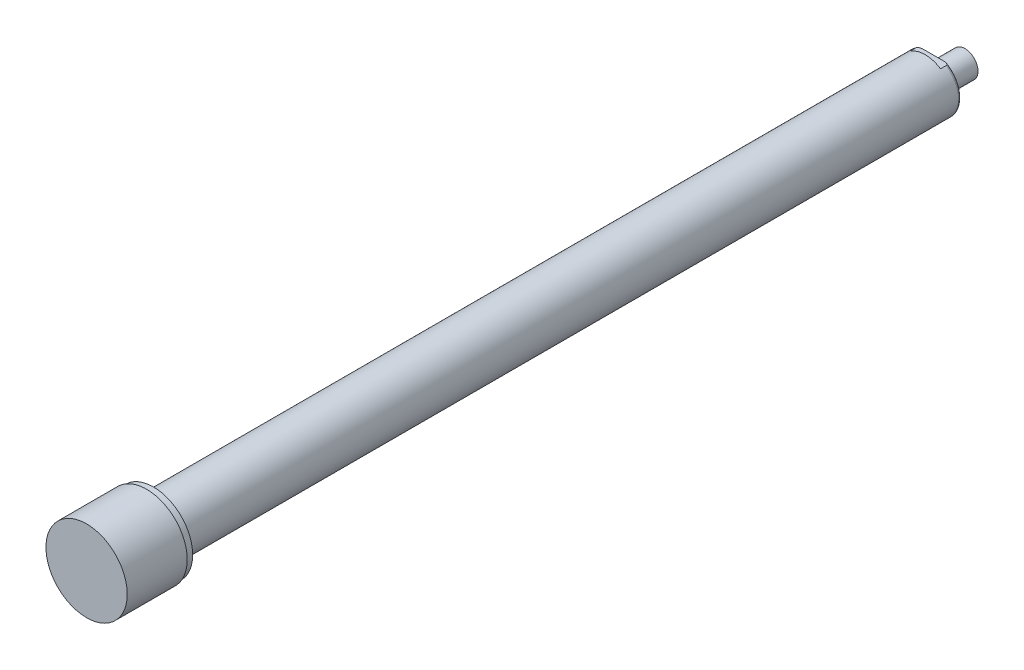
ISO-10303-21;
HEADER;
FILE_DESCRIPTION(('STEP AP214'),'2;1');
FILE_NAME('part.step','',(''),(''),'','','');
FILE_SCHEMA(('AUTOMOTIVE_DESIGN { 1 0 10303 214 1 1 1 1 }'));
ENDSEC;
DATA;
#1=APPLICATION_CONTEXT('core data for automotive mechanical design processes');
#2=APPLICATION_PROTOCOL_DEFINITION('international standard','automotive_design',2000,#1);
#3=PRODUCT_CONTEXT('',#1,'mechanical');
#4=PRODUCT('Part','Part','',(#3));
#5=PRODUCT_RELATED_PRODUCT_CATEGORY('part','',(#4));
#6=PRODUCT_DEFINITION_FORMATION('','',#4);
#7=PRODUCT_DEFINITION_CONTEXT('part definition',#1,'design');
#8=PRODUCT_DEFINITION('design','',#6,#7);
#9=PRODUCT_DEFINITION_SHAPE('','',#8);
#10=(LENGTH_UNIT() NAMED_UNIT(*) SI_UNIT(.MILLI.,.METRE.));
#11=(NAMED_UNIT(*) PLANE_ANGLE_UNIT() SI_UNIT($,.RADIAN.));
#12=(NAMED_UNIT(*) SI_UNIT($,.STERADIAN.) SOLID_ANGLE_UNIT());
#13=UNCERTAINTY_MEASURE_WITH_UNIT(LENGTH_MEASURE(1.E-05),#10,'distance_accuracy_value','');
#14=(GEOMETRIC_REPRESENTATION_CONTEXT(3) GLOBAL_UNCERTAINTY_ASSIGNED_CONTEXT((#13)) GLOBAL_UNIT_ASSIGNED_CONTEXT((#10,
#11,#12)) REPRESENTATION_CONTEXT('',''));
#15=CARTESIAN_POINT('',(0.,0.,0.));
#16=DIRECTION('',(0.,0.,1.));
#17=DIRECTION('',(1.,0.,0.));
#18=AXIS2_PLACEMENT_3D('',#15,#16,#17);
#19=CARTESIAN_POINT('',(0.,0.,2.55016));
#20=DIRECTION('',(0.,0.,1.));
#21=DIRECTION('',(1.,0.,0.));
#22=AXIS2_PLACEMENT_3D('',#19,#20,#21);
#23=PLANE('',#22);
#24=CARTESIAN_POINT('',(0.,0.,2.55016));
#25=DIRECTION('',(0.,0.,1.));
#26=DIRECTION('',(1.,0.,0.));
#27=AXIS2_PLACEMENT_3D('',#24,#25,#26);
#28=CIRCLE('',#27,24.765);
#29=CARTESIAN_POINT('',(24.765,0.,2.55016));
#30=VERTEX_POINT('',#29);
#31=EDGE_CURVE('E152',#30,#30,#28,.T.);
#32=ORIENTED_EDGE('',*,*,#31,.T.);
#33=EDGE_LOOP('',(#32));
#34=FACE_BOUND('',#33,.T.);
#35=ADVANCED_FACE('F16',(#34),#23,.T.);
#36=CARTESIAN_POINT('',(0.,0.,0.));
#37=DIRECTION('',(0.,0.,1.));
#38=DIRECTION('',(1.,0.,0.));
#39=AXIS2_PLACEMENT_3D('',#36,#37,#38);
#40=CYLINDRICAL_SURFACE('',#39,24.765);
#41=CARTESIAN_POINT('',(0.,0.,-34.));
#42=DIRECTION('',(0.,0.,1.));
#43=DIRECTION('',(1.,0.,0.));
#44=AXIS2_PLACEMENT_3D('',#41,#42,#43);
#45=CIRCLE('',#44,24.765);
#46=CARTESIAN_POINT('',(24.765,0.,-34.));
#47=VERTEX_POINT('',#46);
#48=EDGE_CURVE('E25',#47,#47,#45,.F.);
#49=ORIENTED_EDGE('',*,*,#48,.F.);
#50=EDGE_LOOP('',(#49));
#51=FACE_BOUND('',#50,.T.);
#52=ORIENTED_EDGE('',*,*,#31,.F.);
#53=EDGE_LOOP('',(#52));
#54=FACE_BOUND('',#53,.T.);
#55=ADVANCED_FACE('F182',(#51,#54),#40,.T.);
#56=CARTESIAN_POINT('',(0.,20.0152,-34.));
#57=DIRECTION('',(0.,0.,1.));
#58=DIRECTION('',(1.,0.,0.));
#59=AXIS2_PLACEMENT_3D('',#56,#57,#58);
#60=PLANE('',#59);
#61=CARTESIAN_POINT('',(0.,0.,-34.));
#62=DIRECTION('',(0.,0.,1.));
#63=DIRECTION('',(1.,0.,0.));
#64=AXIS2_PLACEMENT_3D('',#61,#62,#63);
#65=CIRCLE('',#64,23.876);
#66=CARTESIAN_POINT('',(23.876,0.,-34.));
#67=VERTEX_POINT('',#66);
#68=EDGE_CURVE('E10',#67,#67,#65,.F.);
#69=ORIENTED_EDGE('',*,*,#68,.F.);
#70=EDGE_LOOP('',(#69));
#71=FACE_BOUND('',#70,.T.);
#72=ORIENTED_EDGE('',*,*,#48,.T.);
#73=EDGE_LOOP('',(#72));
#74=FACE_BOUND('',#73,.T.);
#75=ADVANCED_FACE('F173',(#71,#74),#60,.F.);
#76=CARTESIAN_POINT('',(0.,8.,-532.5004));
#77=DIRECTION('',(0.,0.,-1.));
#78=DIRECTION('',(-1.,0.,0.));
#79=AXIS2_PLACEMENT_3D('',#76,#77,#78);
#80=PLANE('',#79);
#81=CARTESIAN_POINT('',(0.,0.,-532.5004));
#82=DIRECTION('',(0.,0.,-1.));
#83=DIRECTION('',(-1.,0.,0.));
#84=AXIS2_PLACEMENT_3D('',#81,#82,#83);
#85=CIRCLE('',#84,8.);
#86=CARTESIAN_POINT('',(-8.,0.,-532.5004));
#87=VERTEX_POINT('',#86);
#88=EDGE_CURVE('E130',#87,#87,#85,.T.);
#89=ORIENTED_EDGE('',*,*,#88,.T.);
#90=EDGE_LOOP('',(#89));
#91=FACE_BOUND('',#90,.T.);
#92=ADVANCED_FACE('F118',(#91),#80,.T.);
#93=CARTESIAN_POINT('',(0.,0.,-532.5004));
#94=DIRECTION('',(0.,0.,-1.));
#95=DIRECTION('',(-1.,0.,0.));
#96=AXIS2_PLACEMENT_3D('',#93,#94,#95);
#97=CYLINDRICAL_SURFACE('',#96,8.);
#98=CARTESIAN_POINT('',(0.,0.,-515.9904));
#99=DIRECTION('',(0.,0.,-1.));
#100=DIRECTION('',(-1.,0.,0.));
#101=AXIS2_PLACEMENT_3D('',#98,#99,#100);
#102=CIRCLE('',#101,8.);
#103=CARTESIAN_POINT('',(-8.,0.,-515.9904));
#104=VERTEX_POINT('',#103);
#105=EDGE_CURVE('E133',#104,#104,#102,.T.);
#106=ORIENTED_EDGE('',*,*,#105,.T.);
#107=EDGE_LOOP('',(#106));
#108=FACE_BOUND('',#107,.T.);
#109=ORIENTED_EDGE('',*,*,#88,.F.);
#110=EDGE_LOOP('',(#109));
#111=FACE_BOUND('',#110,.T.);
#112=ADVANCED_FACE('F172',(#108,#111),#97,.T.);
#113=CARTESIAN_POINT('',(0.,6.858,-515.9904));
#114=DIRECTION('',(0.,0.,1.));
#115=DIRECTION('',(1.,0.,0.));
#116=AXIS2_PLACEMENT_3D('',#113,#114,#115);
#117=PLANE('',#116);
#118=CARTESIAN_POINT('',(0.,0.,-515.9904));
#119=DIRECTION('',(0.,0.,-1.));
#120=DIRECTION('',(-1.,0.,0.));
#121=AXIS2_PLACEMENT_3D('',#118,#119,#120);
#122=CIRCLE('',#121,6.858);
#123=CARTESIAN_POINT('',(-6.858,0.,-515.9904));
#124=VERTEX_POINT('',#123);
#125=EDGE_CURVE('E136',#124,#124,#122,.T.);
#126=ORIENTED_EDGE('',*,*,#125,.T.);
#127=EDGE_LOOP('',(#126));
#128=FACE_BOUND('',#127,.T.);
#129=ORIENTED_EDGE('',*,*,#105,.F.);
#130=EDGE_LOOP('',(#129));
#131=FACE_BOUND('',#130,.T.);
#132=ADVANCED_FACE('F180',(#128,#131),#117,.T.);
#133=CARTESIAN_POINT('',(0.,0.,-532.5004));
#134=DIRECTION('',(0.,0.,-1.));
#135=DIRECTION('',(-1.,0.,0.));
#136=AXIS2_PLACEMENT_3D('',#133,#134,#135);
#137=CYLINDRICAL_SURFACE('',#136,6.858);
#138=CARTESIAN_POINT('',(0.,0.,-513.4504));
#139=DIRECTION('',(0.,0.,-1.));
#140=DIRECTION('',(-1.,0.,0.));
#141=AXIS2_PLACEMENT_3D('',#138,#139,#140);
#142=CIRCLE('',#141,6.858);
#143=CARTESIAN_POINT('',(-6.858,0.,-513.4504));
#144=VERTEX_POINT('',#143);
#145=EDGE_CURVE('E139',#144,#144,#142,.T.);
#146=ORIENTED_EDGE('',*,*,#145,.T.);
#147=EDGE_LOOP('',(#146));
#148=FACE_BOUND('',#147,.T.);
#149=ORIENTED_EDGE('',*,*,#125,.F.);
#150=EDGE_LOOP('',(#149));
#151=FACE_BOUND('',#150,.T.);
#152=ADVANCED_FACE('F311',(#148,#151),#137,.T.);
#153=CARTESIAN_POINT('',(0.,15.2125,-513.4504));
#154=DIRECTION('',(0.,0.,-1.));
#155=DIRECTION('',(-1.,0.,0.));
#156=AXIS2_PLACEMENT_3D('',#153,#154,#155);
#157=PLANE('',#156);
#158=DIRECTION('',(-1.,0.,0.));
#159=VECTOR('',#158,1.);
#160=CARTESIAN_POINT('',(0.,14.,-513.4504));
#161=LINE('',#160,#159);
#162=CARTESIAN_POINT('',(5.95148353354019,14.,-513.4504));
#163=VERTEX_POINT('',#162);
#164=CARTESIAN_POINT('',(-5.95148353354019,14.,-513.4504));
#165=VERTEX_POINT('',#164);
#166=EDGE_CURVE('E151',#163,#165,#161,.T.);
#167=ORIENTED_EDGE('',*,*,#166,.F.);
#168=CARTESIAN_POINT('',(0.,0.,-513.4504));
#169=DIRECTION('',(0.,0.,-1.));
#170=DIRECTION('',(-1.,0.,0.));
#171=AXIS2_PLACEMENT_3D('',#168,#169,#170);
#172=CIRCLE('',#171,15.2125);
#173=CARTESIAN_POINT('',(5.95148353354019,-14.,-513.4504));
#174=VERTEX_POINT('',#173);
#175=EDGE_CURVE('E142',#163,#174,#172,.T.);
#176=ORIENTED_EDGE('',*,*,#175,.T.);
#177=DIRECTION('',(1.,0.,0.));
#178=VECTOR('',#177,1.);
#179=CARTESIAN_POINT('',(0.,-14.,-513.4504));
#180=LINE('',#179,#178);
#181=CARTESIAN_POINT('',(-5.95148353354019,-14.,-513.4504));
#182=VERTEX_POINT('',#181);
#183=EDGE_CURVE('E149',#182,#174,#180,.T.);
#184=ORIENTED_EDGE('',*,*,#183,.F.);
#185=EDGE_CURVE('E143',#182,#165,#172,.T.);
#186=ORIENTED_EDGE('',*,*,#185,.T.);
#187=EDGE_LOOP('',(#167,#176,#184,#186));
#188=FACE_BOUND('',#187,.T.);
#189=ORIENTED_EDGE('',*,*,#145,.F.);
#190=EDGE_LOOP('',(#189));
#191=FACE_BOUND('',#190,.T.);
#192=ADVANCED_FACE('F302',(#188,#191),#157,.T.);
#193=CARTESIAN_POINT('',(0.,0.,-508.3704));
#194=DIRECTION('',(0.,0.,-1.));
#195=DIRECTION('',(-1.,0.,0.));
#196=AXIS2_PLACEMENT_3D('',#193,#194,#195);
#197=PLANE('',#196);
#198=CARTESIAN_POINT('',(0.,0.,-508.3704));
#199=DIRECTION('',(0.,0.,-1.));
#200=DIRECTION('',(-1.,0.,0.));
#201=AXIS2_PLACEMENT_3D('',#198,#199,#200);
#202=CIRCLE('',#201,16.8);
#203=CARTESIAN_POINT('',(-9.28654941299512,14.,-508.3704));
#204=VERTEX_POINT('',#203);
#205=CARTESIAN_POINT('',(9.28654941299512,14.,-508.3704));
#206=VERTEX_POINT('',#205);
#207=EDGE_CURVE('E72',#204,#206,#202,.T.);
#208=ORIENTED_EDGE('',*,*,#207,.T.);
#209=DIRECTION('',(-1.,0.,0.));
#210=VECTOR('',#209,1.);
#211=CARTESIAN_POINT('',(9.28654941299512,14.,-508.3704));
#212=LINE('',#211,#210);
#213=EDGE_CURVE('E75',#206,#204,#212,.T.);
#214=ORIENTED_EDGE('',*,*,#213,.T.);
#215=EDGE_LOOP('',(#208,#214));
#216=FACE_BOUND('',#215,.T.);
#217=ADVANCED_FACE('F74',(#216),#197,.T.);
#218=CARTESIAN_POINT('',(0.,0.,-511.8629));
#219=DIRECTION('',(0.,0.,-1.));
#220=DIRECTION('',(-1.,0.,0.));
#221=AXIS2_PLACEMENT_3D('',#218,#219,#220);
#222=TOROIDAL_SURFACE('',#221,15.2125,1.5875);
#223=CARTESIAN_POINT('',(0.,14.,-512.887595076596));
#224=CARTESIAN_POINT('',(-0.132768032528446,14.,-512.887593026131));
#225=CARTESIAN_POINT('',(-0.265533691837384,14.,-512.889844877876));
#226=CARTESIAN_POINT('',(-0.5309243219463,14.,-512.898671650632));
#227=CARTESIAN_POINT('',(-0.663549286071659,14.,-512.905246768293));
#228=CARTESIAN_POINT('',(-1.06113740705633,14.,-512.93082076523));
#229=CARTESIAN_POINT('',(-1.32572041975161,14.,-512.955667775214));
#230=CARTESIAN_POINT('',(-1.85467558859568,14.,-513.015304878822));
#231=CARTESIAN_POINT('',(-2.11904315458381,14.,-513.05013225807));
#232=CARTESIAN_POINT('',(-2.64722640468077,14.,-513.123362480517));
#233=CARTESIAN_POINT('',(-2.91104215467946,14.,-513.161764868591));
#234=CARTESIAN_POINT('',(-3.34668840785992,14.,-513.223564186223));
#235=CARTESIAN_POINT('',(-3.51843693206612,14.,-513.24751393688));
#236=CARTESIAN_POINT('',(-3.86222256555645,14.,-513.293226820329));
#237=CARTESIAN_POINT('',(-4.03425968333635,14.,-513.314989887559));
#238=CARTESIAN_POINT('',(-4.5509687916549,14.,-513.375020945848));
#239=CARTESIAN_POINT('',(-4.89633775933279,14.,-513.408046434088));
#240=CARTESIAN_POINT('',(-5.43248455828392,14.,-513.439635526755));
#241=CARTESIAN_POINT('',(-5.62271612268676,14.,-513.447024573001));
#242=CARTESIAN_POINT('',(-6.00342493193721,14.,-513.451964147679));
#243=CARTESIAN_POINT('',(-6.19390224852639,14.,-513.449510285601));
#244=CARTESIAN_POINT('',(-6.57443040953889,14.,-513.43206589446));
#245=CARTESIAN_POINT('',(-6.76448114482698,14.,-513.417072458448));
#246=CARTESIAN_POINT('',(-7.04800150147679,14.,-513.382528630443));
#247=CARTESIAN_POINT('',(-7.14221305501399,14.,-513.369012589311));
#248=CARTESIAN_POINT('',(-7.32985530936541,14.,-513.337394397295));
#249=CARTESIAN_POINT('',(-7.42328618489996,14.,-513.319293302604));
#250=CARTESIAN_POINT('',(-7.60981224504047,14.,-513.277657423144));
#251=CARTESIAN_POINT('',(-7.70289714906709,14.,-513.254075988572));
#252=CARTESIAN_POINT('',(-7.88726094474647,14.,-513.20074825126));
#253=CARTESIAN_POINT('',(-7.97854070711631,14.,-513.17100500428));
#254=CARTESIAN_POINT('',(-8.15800808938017,14.,-513.104496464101));
#255=CARTESIAN_POINT('',(-8.24620915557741,14.,-513.067767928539));
#256=CARTESIAN_POINT('',(-8.41861308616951,14.,-512.985991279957));
#257=CARTESIAN_POINT('',(-8.5028211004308,14.,-512.940954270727));
#258=CARTESIAN_POINT('',(-8.64739637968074,14.,-512.852038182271));
#259=CARTESIAN_POINT('',(-8.70893575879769,14.,-512.810080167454));
#260=CARTESIAN_POINT('',(-8.82695536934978,14.,-512.719330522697));
#261=CARTESIAN_POINT('',(-8.88342980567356,14.,-512.670531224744));
#262=CARTESIAN_POINT('',(-8.98963579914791,14.,-512.564856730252));
#263=CARTESIAN_POINT('',(-9.0392861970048,14.,-512.507898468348));
#264=CARTESIAN_POINT('',(-9.1277798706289,14.,-512.3861116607));
#265=CARTESIAN_POINT('',(-9.16665238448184,14.,-512.321305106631));
#266=CARTESIAN_POINT('',(-9.22003745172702,14.,-512.205711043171));
#267=CARTESIAN_POINT('',(-9.23836397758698,14.,-512.156688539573));
#268=CARTESIAN_POINT('',(-9.26663253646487,14.,-512.056274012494));
#269=CARTESIAN_POINT('',(-9.27658176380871,14.,-512.00488406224));
#270=CARTESIAN_POINT('',(-9.28727482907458,14.,-511.90094216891));
#271=CARTESIAN_POINT('',(-9.28798383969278,14.,-511.84838657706));
#272=CARTESIAN_POINT('',(-9.28004044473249,14.,-511.74398713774));
#273=CARTESIAN_POINT('',(-9.27138562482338,14.,-511.692143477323));
#274=CARTESIAN_POINT('',(-9.24609238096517,14.,-511.593096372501));
#275=CARTESIAN_POINT('',(-9.22985055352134,14.,-511.545789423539));
#276=CARTESIAN_POINT('',(-9.19066177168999,14.,-511.454071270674));
#277=CARTESIAN_POINT('',(-9.16771223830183,14.,-511.409661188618));
#278=CARTESIAN_POINT('',(-9.1028532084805,14.,-511.301841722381));
#279=CARTESIAN_POINT('',(-9.05730159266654,14.,-511.240624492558));
#280=CARTESIAN_POINT('',(-8.95711629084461,14.,-511.12613877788));
#281=CARTESIAN_POINT('',(-8.90245884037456,14.,-511.072891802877));
#282=CARTESIAN_POINT('',(-8.75205778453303,14.,-510.943960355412));
#283=CARTESIAN_POINT('',(-8.6513883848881,14.,-510.874065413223));
#284=CARTESIAN_POINT('',(-8.44094705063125,14.,-510.749906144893));
#285=CARTESIAN_POINT('',(-8.33115456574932,14.,-510.695678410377));
#286=CARTESIAN_POINT('',(-8.11312892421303,14.,-510.602886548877));
#287=CARTESIAN_POINT('',(-8.0052101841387,14.,-510.563567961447));
#288=CARTESIAN_POINT('',(-7.78638225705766,14.,-510.494218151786));
#289=CARTESIAN_POINT('',(-7.67547044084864,14.,-510.46419540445));
#290=CARTESIAN_POINT('',(-7.45172845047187,14.,-510.41194530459));
#291=CARTESIAN_POINT('',(-7.33889625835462,14.,-510.389726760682));
#292=CARTESIAN_POINT('',(-7.11210332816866,14.,-510.351935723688));
#293=CARTESIAN_POINT('',(-6.9981421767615,14.,-510.336365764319));
#294=CARTESIAN_POINT('',(-6.76357841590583,14.,-510.310250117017));
#295=CARTESIAN_POINT('',(-6.64294221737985,14.,-510.300012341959));
#296=CARTESIAN_POINT('',(-6.40132401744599,14.,-510.284929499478));
#297=CARTESIAN_POINT('',(-6.28034194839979,14.,-510.28008557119));
#298=CARTESIAN_POINT('',(-5.91706739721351,14.,-510.272460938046));
#299=CARTESIAN_POINT('',(-5.67462782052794,14.,-510.276605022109));
#300=CARTESIAN_POINT('',(-5.18958172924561,14.,-510.298383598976));
#301=CARTESIAN_POINT('',(-4.94697788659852,14.,-510.316067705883));
#302=CARTESIAN_POINT('',(-4.4628147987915,14.,-510.360899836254));
#303=CARTESIAN_POINT('',(-4.22125506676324,14.,-510.388042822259));
#304=CARTESIAN_POINT('',(-3.66652722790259,14.,-510.457108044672));
#305=CARTESIAN_POINT('',(-3.35361868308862,14.,-510.50102115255));
#306=CARTESIAN_POINT('',(-2.72786060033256,14.,-510.59038682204));
#307=CARTESIAN_POINT('',(-2.41501121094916,14.,-510.635840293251));
#308=CARTESIAN_POINT('',(-1.7909190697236,14.,-510.718284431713));
#309=CARTESIAN_POINT('',(-1.4796869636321,14.,-510.755347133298));
#310=CARTESIAN_POINT('',(-1.01173384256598,14.,-510.797283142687));
#311=CARTESIAN_POINT('',(-0.85564734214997,14.,-510.808982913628));
#312=CARTESIAN_POINT('',(-0.543154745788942,14.,-510.826808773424));
#313=CARTESIAN_POINT('',(-0.386748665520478,14.,-510.832935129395));
#314=CARTESIAN_POINT('',(-0.0729452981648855,14.,-510.839018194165));
#315=CARTESIAN_POINT('',(0.0844526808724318,14.,-510.838940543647));
#316=CARTESIAN_POINT('',(0.399120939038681,14.,-510.832538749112));
#317=CARTESIAN_POINT('',(0.556391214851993,14.,-510.826214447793));
#318=CARTESIAN_POINT('',(0.870747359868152,14.,-510.807945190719));
#319=CARTESIAN_POINT('',(1.02783290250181,14.,-510.795994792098));
#320=CARTESIAN_POINT('',(1.34159739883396,14.,-510.767550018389));
#321=CARTESIAN_POINT('',(1.49827630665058,14.,-510.751055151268));
#322=CARTESIAN_POINT('',(1.81316576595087,14.,-510.714583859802));
#323=CARTESIAN_POINT('',(1.97137154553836,14.,-510.694567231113));
#324=CARTESIAN_POINT('',(2.28750928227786,14.,-510.652537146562));
#325=CARTESIAN_POINT('',(2.44544124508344,14.,-510.630523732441));
#326=CARTESIAN_POINT('',(2.91891159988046,14.,-510.563449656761));
#327=CARTESIAN_POINT('',(3.23429351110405,14.,-510.517332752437));
#328=CARTESIAN_POINT('',(3.86696922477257,14.,-510.431141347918));
#329=CARTESIAN_POINT('',(4.18426592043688,14.,-510.39108632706));
#330=CARTESIAN_POINT('',(4.6616022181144,14.,-510.341907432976));
#331=CARTESIAN_POINT('',(4.82106369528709,14.,-510.327325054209));
#332=CARTESIAN_POINT('',(5.14034359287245,14.,-510.302922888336));
#333=CARTESIAN_POINT('',(5.30016197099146,14.,-510.293102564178));
#334=CARTESIAN_POINT('',(5.61795638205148,14.,-510.279521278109));
#335=CARTESIAN_POINT('',(5.77592887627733,14.,-510.275682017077));
#336=CARTESIAN_POINT('',(6.09195057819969,14.,-510.27514758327));
#337=CARTESIAN_POINT('',(6.24999979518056,14.,-510.278454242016));
#338=CARTESIAN_POINT('',(6.56527224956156,14.,-510.293786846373));
#339=CARTESIAN_POINT('',(6.72249656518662,14.,-510.305789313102));
#340=CARTESIAN_POINT('',(7.03573124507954,14.,-510.340441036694));
#341=CARTESIAN_POINT('',(7.19174244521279,14.,-510.363082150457));
#342=CARTESIAN_POINT('',(7.41615197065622,14.,-510.405489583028));
#343=CARTESIAN_POINT('',(7.48555710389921,14.,-510.419991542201));
#344=CARTESIAN_POINT('',(7.62369369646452,14.,-510.451975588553));
#345=CARTESIAN_POINT('',(7.69242507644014,14.,-510.469458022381));
#346=CARTESIAN_POINT('',(7.82924857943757,14.,-510.507814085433));
#347=CARTESIAN_POINT('',(7.8973368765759,14.,-510.528701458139));
#348=CARTESIAN_POINT('',(8.03225786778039,14.,-510.574211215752));
#349=CARTESIAN_POINT('',(8.099090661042,14.,-510.598833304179));
#350=CARTESIAN_POINT('',(8.23194606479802,14.,-510.652631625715));
#351=CARTESIAN_POINT('',(8.29794618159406,14.,-510.681863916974));
#352=CARTESIAN_POINT('',(8.42761843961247,14.,-510.745218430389));
#353=CARTESIAN_POINT('',(8.49128951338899,14.,-510.779342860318));
#354=CARTESIAN_POINT('',(8.61506191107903,14.,-510.85292848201));
#355=CARTESIAN_POINT('',(8.67517993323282,14.,-510.892361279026));
#356=CARTESIAN_POINT('',(8.79087032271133,14.,-510.977343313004));
#357=CARTESIAN_POINT('',(8.84644896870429,14.,-511.022883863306));
#358=CARTESIAN_POINT('',(8.94548291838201,14.,-511.115317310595));
#359=CARTESIAN_POINT('',(8.98959902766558,14.,-511.161494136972));
#360=CARTESIAN_POINT('',(9.07112763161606,14.,-511.259534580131));
#361=CARTESIAN_POINT('',(9.10853908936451,14.,-511.311399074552));
#362=CARTESIAN_POINT('',(9.17478487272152,14.,-511.421313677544));
#363=CARTESIAN_POINT('',(9.20351043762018,14.,-511.479430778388));
#364=CARTESIAN_POINT('',(9.24908813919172,14.,-511.600152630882));
#365=CARTESIAN_POINT('',(9.26596285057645,14.,-511.662748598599));
#366=CARTESIAN_POINT('',(9.28464960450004,14.,-511.782335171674));
#367=CARTESIAN_POINT('',(9.28804963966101,14.,-511.83907661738));
#368=CARTESIAN_POINT('',(9.28382966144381,14.,-511.952145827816));
#369=CARTESIAN_POINT('',(9.27621073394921,14.,-512.008473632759));
#370=CARTESIAN_POINT('',(9.25229003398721,14.,-512.112102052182));
#371=CARTESIAN_POINT('',(9.23713577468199,14.,-512.159676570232));
#372=CARTESIAN_POINT('',(9.19997892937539,14.,-512.252038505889));
#373=CARTESIAN_POINT('',(9.17797466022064,14.,-512.296825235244));
#374=CARTESIAN_POINT('',(9.11609014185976,14.,-512.404302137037));
#375=CARTESIAN_POINT('',(9.07273694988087,14.,-512.464990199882));
#376=CARTESIAN_POINT('',(8.97697606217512,14.,-512.578741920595));
#377=CARTESIAN_POINT('',(8.92454537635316,14.,-512.631785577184));
#378=CARTESIAN_POINT('',(8.78073012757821,14.,-512.759735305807));
#379=CARTESIAN_POINT('',(8.68454281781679,14.,-512.829202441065));
#380=CARTESIAN_POINT('',(8.48303059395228,14.,-512.953115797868));
#381=CARTESIAN_POINT('',(8.37768429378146,14.,-513.007525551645));
#382=CARTESIAN_POINT('',(8.16908427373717,14.,-513.100673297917));
#383=CARTESIAN_POINT('',(8.06619117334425,14.,-513.140235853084));
#384=CARTESIAN_POINT('',(7.85737031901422,14.,-513.210483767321));
#385=CARTESIAN_POINT('',(7.75143986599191,14.,-513.241160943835));
#386=CARTESIAN_POINT('',(7.53762663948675,14.,-513.295024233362));
#387=CARTESIAN_POINT('',(7.42974224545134,14.,-513.318203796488));
#388=CARTESIAN_POINT('',(7.21287186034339,14.,-513.358141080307));
#389=CARTESIAN_POINT('',(7.10388648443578,14.,-513.374902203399));
#390=CARTESIAN_POINT('',(6.89130219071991,14.,-513.402143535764));
#391=CARTESIAN_POINT('',(6.78774054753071,14.,-513.412921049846));
#392=CARTESIAN_POINT('',(6.58025497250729,14.,-513.430196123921));
#393=CARTESIAN_POINT('',(6.47633098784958,14.,-513.436693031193));
#394=CARTESIAN_POINT('',(6.16416768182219,14.,-513.450589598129));
#395=CARTESIAN_POINT('',(5.95567421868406,14.,-513.452379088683));
#396=CARTESIAN_POINT('',(5.53835436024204,14.,-513.44450473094));
#397=CARTESIAN_POINT('',(5.32952888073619,14.,-513.434806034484));
#398=CARTESIAN_POINT('',(4.91243398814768,14.,-513.406724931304));
#399=CARTESIAN_POINT('',(4.70416474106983,14.,-513.388340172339));
#400=CARTESIAN_POINT('',(4.28654719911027,14.,-513.345186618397));
#401=CARTESIAN_POINT('',(4.07720452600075,14.,-513.320365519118));
#402=CARTESIAN_POINT('',(3.6590508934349,14.,-513.266814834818));
#403=CARTESIAN_POINT('',(3.45023989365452,14.,-513.238085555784));
#404=CARTESIAN_POINT('',(3.03316786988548,14.,-513.179210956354));
#405=CARTESIAN_POINT('',(2.82490650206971,14.,-513.149067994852));
#406=CARTESIAN_POINT('',(2.40822602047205,14.,-513.089971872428));
#407=CARTESIAN_POINT('',(2.19980692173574,14.,-513.061018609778));
#408=CARTESIAN_POINT('',(1.82558056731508,14.,-513.012810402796));
#409=CARTESIAN_POINT('',(1.65987471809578,14.,-512.992788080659));
#410=CARTESIAN_POINT('',(1.32795613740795,14.,-512.956904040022));
#411=CARTESIAN_POINT('',(1.1617432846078,14.,-512.941043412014));
#412=CARTESIAN_POINT('',(0.829734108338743,14.,-512.915025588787));
#413=CARTESIAN_POINT('',(0.663940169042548,14.,-512.904838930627));
#414=CARTESIAN_POINT('',(0.332096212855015,14.,-512.891125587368));
#415=CARTESIAN_POINT('',(0.166046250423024,14.,-512.887597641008));
#416=CARTESIAN_POINT('',(0.,14.,-512.887595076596));
#417=B_SPLINE_CURVE_WITH_KNOTS('',3,(#223,#224,#225,#226,#227,#228,#229,#230,#231,#232,#233,
#234,#235,#236,#237,#238,#239,#240,#241,#242,#243,#244,#245,#246,#247,#248,#249,#250,#251,#252,
#253,#254,#255,#256,#257,#258,#259,#260,#261,#262,#263,#264,#265,#266,#267,#268,#269,#270,#271,
#272,#273,#274,#275,#276,#277,#278,#279,#280,#281,#282,#283,#284,#285,#286,#287,#288,#289,#290,
#291,#292,#293,#294,#295,#296,#297,#298,#299,#300,#301,#302,#303,#304,#305,#306,#307,#308,#309,
#310,#311,#312,#313,#314,#315,#316,#317,#318,#319,#320,#321,#322,#323,#324,#325,#326,#327,#328,
#329,#330,#331,#332,#333,#334,#335,#336,#337,#338,#339,#340,#341,#342,#343,#344,#345,#346,#347,
#348,#349,#350,#351,#352,#353,#354,#355,#356,#357,#358,#359,#360,#361,#362,#363,#364,#365,#366,
#367,#368,#369,#370,#371,#372,#373,#374,#375,#376,#377,#378,#379,#380,#381,#382,#383,#384,#385,
#386,#387,#388,#389,#390,#391,#392,#393,#394,#395,#396,#397,#398,#399,#400,#401,#402,#403,#404,
#405,#406,#407,#408,#409,#410,#411,#412,#413,#414,#415,#416),.UNSPECIFIED.,.T.,.F.,(4,2,2,2,2,2,
2,2,2,2,2,2,2,2,2,2,2,2,2,2,2,2,2,2,2,2,2,2,2,2,2,2,2,2,2,2,2,2,2,2,2,2,2,2,2,2,2,2,2,2,2,2,2,2,
2,2,2,2,2,2,2,2,2,2,2,2,2,2,2,2,2,2,2,2,2,2,2,2,2,2,2,2,2,2,2,2,2,2,2,2,2,2,2,2,2,2,4),(0.,
0.398281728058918,0.796581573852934,1.59346088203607,2.39335695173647,3.19315132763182,
3.71336857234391,4.23360141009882,5.27376582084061,5.84469365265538,6.41587617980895,
6.98719115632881,7.27262913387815,7.55800141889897,7.84589809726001,8.13365234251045,
8.41993230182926,8.70583240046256,8.92889552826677,9.15221070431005,9.37798665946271,
9.60314400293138,9.75952095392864,9.91576347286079,10.0725947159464,10.2294664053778,
10.3789250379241,10.5284412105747,10.7560526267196,10.9842676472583,11.3498680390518,
11.7163155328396,12.0603788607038,12.404754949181,12.7495184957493,13.0944133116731,
13.4574784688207,13.8206202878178,14.547448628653,15.2769530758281,16.0060696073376,
16.9539379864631,17.902376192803,18.8423341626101,19.3118216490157,19.7812866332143,
20.2533518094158,20.7254288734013,21.1979635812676,21.670549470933,22.1489292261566,
22.6272989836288,23.5835269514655,24.54276525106,25.0230897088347,25.5033599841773,
25.977288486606,26.4513384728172,26.9241132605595,27.3965267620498,27.6091866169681,
27.8218712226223,28.0354365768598,28.2489849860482,28.4653650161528,28.681843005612,
28.897205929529,29.1122657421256,29.303362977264,29.4944897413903,29.6879190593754,
29.8809789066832,30.0504588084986,30.2199220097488,30.3691164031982,30.518347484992,
30.7408251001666,30.963874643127,31.3178265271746,31.6726282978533,32.0028505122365,
32.3333758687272,32.664189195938,32.9948269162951,33.3070886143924,33.6193979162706,
34.2444298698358,34.8713626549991,35.4984653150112,36.1308331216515,36.7631514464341,
37.3944498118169,38.0256940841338,38.5263936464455,39.0272242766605,39.5254294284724,
40.0235402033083),.UNSPECIFIED.);
#418=CARTESIAN_POINT('',(9.28654941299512,14.,-511.8629));
#419=VERTEX_POINT('',#418);
#420=EDGE_CURVE('E33',#419,#163,#417,.T.);
#421=ORIENTED_EDGE('',*,*,#420,.F.);
#422=CARTESIAN_POINT('',(0.,0.,-511.8629));
#423=DIRECTION('',(0.,0.,-1.));
#424=DIRECTION('',(-1.,0.,0.));
#425=AXIS2_PLACEMENT_3D('',#422,#423,#424);
#426=CIRCLE('',#425,16.8);
#427=CARTESIAN_POINT('',(9.28654941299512,-14.,-511.8629));
#428=VERTEX_POINT('',#427);
#429=EDGE_CURVE('E86',#419,#428,#426,.T.);
#430=ORIENTED_EDGE('',*,*,#429,.T.);
#431=CARTESIAN_POINT('',(0.,-14.,-512.887595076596));
#432=CARTESIAN_POINT('',(0.132768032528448,-14.,-512.887593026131));
#433=CARTESIAN_POINT('',(0.265533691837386,-14.,-512.889844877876));
#434=CARTESIAN_POINT('',(0.530924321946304,-14.,-512.898671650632));
#435=CARTESIAN_POINT('',(0.663549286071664,-14.,-512.905246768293));
#436=CARTESIAN_POINT('',(1.06113740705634,-14.,-512.93082076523));
#437=CARTESIAN_POINT('',(1.32572041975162,-14.,-512.955667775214));
#438=CARTESIAN_POINT('',(1.85467558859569,-14.,-513.015304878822));
#439=CARTESIAN_POINT('',(2.11904315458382,-14.,-513.05013225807));
#440=CARTESIAN_POINT('',(2.64722640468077,-14.,-513.123362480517));
#441=CARTESIAN_POINT('',(2.91104215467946,-14.,-513.161764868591));
#442=CARTESIAN_POINT('',(3.34668840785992,-14.,-513.223564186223));
#443=CARTESIAN_POINT('',(3.51843693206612,-14.,-513.24751393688));
#444=CARTESIAN_POINT('',(3.86222256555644,-14.,-513.293226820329));
#445=CARTESIAN_POINT('',(4.03425968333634,-14.,-513.314989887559));
#446=CARTESIAN_POINT('',(4.55096879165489,-14.,-513.375020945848));
#447=CARTESIAN_POINT('',(4.89633775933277,-14.,-513.408046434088));
#448=CARTESIAN_POINT('',(5.43248455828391,-14.,-513.439635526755));
#449=CARTESIAN_POINT('',(5.62271612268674,-14.,-513.447024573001));
#450=CARTESIAN_POINT('',(6.00342493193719,-14.,-513.451964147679));
#451=CARTESIAN_POINT('',(6.19390224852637,-14.,-513.449510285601));
#452=CARTESIAN_POINT('',(6.57443040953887,-14.,-513.43206589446));
#453=CARTESIAN_POINT('',(6.76448114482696,-14.,-513.417072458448));
#454=CARTESIAN_POINT('',(7.04800150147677,-14.,-513.382528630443));
#455=CARTESIAN_POINT('',(7.14221305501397,-14.,-513.369012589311));
#456=CARTESIAN_POINT('',(7.32985530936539,-14.,-513.337394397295));
#457=CARTESIAN_POINT('',(7.42328618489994,-14.,-513.319293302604));
#458=CARTESIAN_POINT('',(7.60981224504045,-14.,-513.277657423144));
#459=CARTESIAN_POINT('',(7.70289714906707,-14.,-513.254075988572));
#460=CARTESIAN_POINT('',(7.88726094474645,-14.,-513.20074825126));
#461=CARTESIAN_POINT('',(7.97854070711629,-14.,-513.17100500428));
#462=CARTESIAN_POINT('',(8.15800808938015,-14.,-513.104496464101));
#463=CARTESIAN_POINT('',(8.24620915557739,-14.,-513.067767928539));
#464=CARTESIAN_POINT('',(8.41861308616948,-14.,-512.985991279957));
#465=CARTESIAN_POINT('',(8.50282110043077,-14.,-512.940954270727));
#466=CARTESIAN_POINT('',(8.64739637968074,-14.,-512.852038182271));
#467=CARTESIAN_POINT('',(8.70893575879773,-14.,-512.810080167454));
#468=CARTESIAN_POINT('',(8.82695536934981,-14.,-512.719330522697));
#469=CARTESIAN_POINT('',(8.88342980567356,-14.,-512.670531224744));
#470=CARTESIAN_POINT('',(8.98963579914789,-14.,-512.564856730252));
#471=CARTESIAN_POINT('',(9.03928619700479,-14.,-512.507898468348));
#472=CARTESIAN_POINT('',(9.12777987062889,-14.,-512.3861116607));
#473=CARTESIAN_POINT('',(9.16665238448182,-14.,-512.321305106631));
#474=CARTESIAN_POINT('',(9.22003745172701,-14.,-512.205711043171));
#475=CARTESIAN_POINT('',(9.23836397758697,-14.,-512.156688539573));
#476=CARTESIAN_POINT('',(9.26663253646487,-14.,-512.056274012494));
#477=CARTESIAN_POINT('',(9.27658176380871,-14.,-512.00488406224));
#478=CARTESIAN_POINT('',(9.28727482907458,-14.,-511.90094216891));
#479=CARTESIAN_POINT('',(9.28798383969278,-14.,-511.84838657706));
#480=CARTESIAN_POINT('',(9.28004044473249,-14.,-511.74398713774));
#481=CARTESIAN_POINT('',(9.27138562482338,-14.,-511.692143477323));
#482=CARTESIAN_POINT('',(9.24609238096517,-14.,-511.593096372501));
#483=CARTESIAN_POINT('',(9.22985055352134,-14.,-511.545789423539));
#484=CARTESIAN_POINT('',(9.19066177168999,-14.,-511.454071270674));
#485=CARTESIAN_POINT('',(9.16771223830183,-14.,-511.409661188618));
#486=CARTESIAN_POINT('',(9.1028532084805,-14.,-511.301841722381));
#487=CARTESIAN_POINT('',(9.05730159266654,-14.,-511.240624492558));
#488=CARTESIAN_POINT('',(8.95711629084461,-14.,-511.12613877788));
#489=CARTESIAN_POINT('',(8.90245884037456,-14.,-511.072891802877));
#490=CARTESIAN_POINT('',(8.75205778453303,-14.,-510.943960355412));
#491=CARTESIAN_POINT('',(8.65138838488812,-14.,-510.874065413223));
#492=CARTESIAN_POINT('',(8.44094705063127,-14.,-510.749906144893));
#493=CARTESIAN_POINT('',(8.33115456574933,-14.,-510.695678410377));
#494=CARTESIAN_POINT('',(8.11312892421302,-14.,-510.602886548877));
#495=CARTESIAN_POINT('',(8.0052101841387,-14.,-510.563567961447));
#496=CARTESIAN_POINT('',(7.78638225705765,-14.,-510.494218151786));
#497=CARTESIAN_POINT('',(7.67547044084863,-14.,-510.46419540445));
#498=CARTESIAN_POINT('',(7.45172845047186,-14.,-510.41194530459));
#499=CARTESIAN_POINT('',(7.33889625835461,-14.,-510.389726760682));
#500=CARTESIAN_POINT('',(7.11210332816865,-14.,-510.351935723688));
#501=CARTESIAN_POINT('',(6.99814217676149,-14.,-510.336365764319));
#502=CARTESIAN_POINT('',(6.76357841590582,-14.,-510.310250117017));
#503=CARTESIAN_POINT('',(6.64294221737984,-14.,-510.300012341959));
#504=CARTESIAN_POINT('',(6.40132401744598,-14.,-510.284929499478));
#505=CARTESIAN_POINT('',(6.28034194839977,-14.,-510.28008557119));
#506=CARTESIAN_POINT('',(5.9170673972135,-14.,-510.272460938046));
#507=CARTESIAN_POINT('',(5.67462782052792,-14.,-510.276605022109));
#508=CARTESIAN_POINT('',(5.18958172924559,-14.,-510.298383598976));
#509=CARTESIAN_POINT('',(4.94697788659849,-14.,-510.316067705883));
#510=CARTESIAN_POINT('',(4.46281479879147,-14.,-510.360899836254));
#511=CARTESIAN_POINT('',(4.22125506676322,-14.,-510.388042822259));
#512=CARTESIAN_POINT('',(3.66652722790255,-14.,-510.457108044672));
#513=CARTESIAN_POINT('',(3.35361868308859,-14.,-510.50102115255));
#514=CARTESIAN_POINT('',(2.72786060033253,-14.,-510.59038682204));
#515=CARTESIAN_POINT('',(2.41501121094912,-14.,-510.635840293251));
#516=CARTESIAN_POINT('',(1.79091906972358,-14.,-510.718284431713));
#517=CARTESIAN_POINT('',(1.47968696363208,-14.,-510.755347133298));
#518=CARTESIAN_POINT('',(1.01173384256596,-14.,-510.797283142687));
#519=CARTESIAN_POINT('',(0.855647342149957,-14.,-510.808982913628));
#520=CARTESIAN_POINT('',(0.54315474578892,-14.,-510.826808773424));
#521=CARTESIAN_POINT('',(0.386748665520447,-14.,-510.832935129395));
#522=CARTESIAN_POINT('',(0.0729452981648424,-14.,-510.839018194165));
#523=CARTESIAN_POINT('',(-0.0844526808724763,-14.,-510.838940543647));
#524=CARTESIAN_POINT('',(-0.399120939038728,-14.,-510.832538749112));
#525=CARTESIAN_POINT('',(-0.556391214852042,-14.,-510.826214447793));
#526=CARTESIAN_POINT('',(-0.870747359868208,-14.,-510.807945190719));
#527=CARTESIAN_POINT('',(-1.02783290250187,-14.,-510.795994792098));
#528=CARTESIAN_POINT('',(-1.34159739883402,-14.,-510.767550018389));
#529=CARTESIAN_POINT('',(-1.49827630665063,-14.,-510.751055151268));
#530=CARTESIAN_POINT('',(-1.81316576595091,-14.,-510.714583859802));
#531=CARTESIAN_POINT('',(-1.9713715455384,-14.,-510.694567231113));
#532=CARTESIAN_POINT('',(-2.2875092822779,-14.,-510.652537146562));
#533=CARTESIAN_POINT('',(-2.44544124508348,-14.,-510.630523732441));
#534=CARTESIAN_POINT('',(-2.91891159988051,-14.,-510.563449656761));
#535=CARTESIAN_POINT('',(-3.2342935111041,-14.,-510.517332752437));
#536=CARTESIAN_POINT('',(-3.86696922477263,-14.,-510.431141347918));
#537=CARTESIAN_POINT('',(-4.18426592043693,-14.,-510.39108632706));
#538=CARTESIAN_POINT('',(-4.66160221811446,-14.,-510.341907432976));
#539=CARTESIAN_POINT('',(-4.82106369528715,-14.,-510.327325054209));
#540=CARTESIAN_POINT('',(-5.14034359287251,-14.,-510.302922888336));
#541=CARTESIAN_POINT('',(-5.30016197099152,-14.,-510.293102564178));
#542=CARTESIAN_POINT('',(-5.61795638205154,-14.,-510.279521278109));
#543=CARTESIAN_POINT('',(-5.77592887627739,-14.,-510.275682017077));
#544=CARTESIAN_POINT('',(-6.09195057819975,-14.,-510.27514758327));
#545=CARTESIAN_POINT('',(-6.24999979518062,-14.,-510.278454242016));
#546=CARTESIAN_POINT('',(-6.56527224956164,-14.,-510.293786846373));
#547=CARTESIAN_POINT('',(-6.72249656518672,-14.,-510.305789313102));
#548=CARTESIAN_POINT('',(-7.03573124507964,-14.,-510.340441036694));
#549=CARTESIAN_POINT('',(-7.19174244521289,-14.,-510.363082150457));
#550=CARTESIAN_POINT('',(-7.41615197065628,-14.,-510.405489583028));
#551=CARTESIAN_POINT('',(-7.48555710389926,-14.,-510.419991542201));
#552=CARTESIAN_POINT('',(-7.62369369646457,-14.,-510.451975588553));
#553=CARTESIAN_POINT('',(-7.69242507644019,-14.,-510.469458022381));
#554=CARTESIAN_POINT('',(-7.82924857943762,-14.,-510.507814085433));
#555=CARTESIAN_POINT('',(-7.89733687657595,-14.,-510.528701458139));
#556=CARTESIAN_POINT('',(-8.03225786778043,-14.,-510.574211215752));
#557=CARTESIAN_POINT('',(-8.09909066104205,-14.,-510.598833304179));
#558=CARTESIAN_POINT('',(-8.23194606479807,-14.,-510.652631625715));
#559=CARTESIAN_POINT('',(-8.29794618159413,-14.,-510.681863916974));
#560=CARTESIAN_POINT('',(-8.42761843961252,-14.,-510.745218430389));
#561=CARTESIAN_POINT('',(-8.49128951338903,-14.,-510.779342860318));
#562=CARTESIAN_POINT('',(-8.61506191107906,-14.,-510.85292848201));
#563=CARTESIAN_POINT('',(-8.67517993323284,-14.,-510.892361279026));
#564=CARTESIAN_POINT('',(-8.79087032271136,-14.,-510.977343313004));
#565=CARTESIAN_POINT('',(-8.84644896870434,-14.,-511.022883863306));
#566=CARTESIAN_POINT('',(-8.94548291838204,-14.,-511.115317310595));
#567=CARTESIAN_POINT('',(-8.9895990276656,-14.,-511.161494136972));
#568=CARTESIAN_POINT('',(-9.07112763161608,-14.,-511.259534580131));
#569=CARTESIAN_POINT('',(-9.10853908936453,-14.,-511.311399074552));
#570=CARTESIAN_POINT('',(-9.17478487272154,-14.,-511.421313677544));
#571=CARTESIAN_POINT('',(-9.20351043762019,-14.,-511.479430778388));
#572=CARTESIAN_POINT('',(-9.24908813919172,-14.,-511.600152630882));
#573=CARTESIAN_POINT('',(-9.26596285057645,-14.,-511.662748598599));
#574=CARTESIAN_POINT('',(-9.28464960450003,-14.,-511.782335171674));
#575=CARTESIAN_POINT('',(-9.28804963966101,-14.,-511.83907661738));
#576=CARTESIAN_POINT('',(-9.28382966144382,-14.,-511.952145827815));
#577=CARTESIAN_POINT('',(-9.27621073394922,-14.,-512.008473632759));
#578=CARTESIAN_POINT('',(-9.25229003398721,-14.,-512.112102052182));
#579=CARTESIAN_POINT('',(-9.23713577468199,-14.,-512.159676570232));
#580=CARTESIAN_POINT('',(-9.19997892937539,-14.,-512.252038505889));
#581=CARTESIAN_POINT('',(-9.17797466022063,-14.,-512.296825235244));
#582=CARTESIAN_POINT('',(-9.11609014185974,-14.,-512.404302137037));
#583=CARTESIAN_POINT('',(-9.07273694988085,-14.,-512.464990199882));
#584=CARTESIAN_POINT('',(-8.9769760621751,-14.,-512.578741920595));
#585=CARTESIAN_POINT('',(-8.92454537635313,-14.,-512.631785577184));
#586=CARTESIAN_POINT('',(-8.78073012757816,-14.,-512.759735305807));
#587=CARTESIAN_POINT('',(-8.68454281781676,-14.,-512.829202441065));
#588=CARTESIAN_POINT('',(-8.48303059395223,-14.,-512.953115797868));
#589=CARTESIAN_POINT('',(-8.3776842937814,-14.,-513.007525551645));
#590=CARTESIAN_POINT('',(-8.1690842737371,-14.,-513.100673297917));
#591=CARTESIAN_POINT('',(-8.06619117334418,-14.,-513.140235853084));
#592=CARTESIAN_POINT('',(-7.85737031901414,-14.,-513.210483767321));
#593=CARTESIAN_POINT('',(-7.75143986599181,-14.,-513.241160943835));
#594=CARTESIAN_POINT('',(-7.53762663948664,-14.,-513.295024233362));
#595=CARTESIAN_POINT('',(-7.42974224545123,-14.,-513.318203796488));
#596=CARTESIAN_POINT('',(-7.21287186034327,-14.,-513.358141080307));
#597=CARTESIAN_POINT('',(-7.10388648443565,-14.,-513.374902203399));
#598=CARTESIAN_POINT('',(-6.89130219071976,-14.,-513.402143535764));
#599=CARTESIAN_POINT('',(-6.78774054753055,-14.,-513.412921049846));
#600=CARTESIAN_POINT('',(-6.58025497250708,-14.,-513.430196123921));
#601=CARTESIAN_POINT('',(-6.47633098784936,-14.,-513.436693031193));
#602=CARTESIAN_POINT('',(-6.16416768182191,-14.,-513.450589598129));
#603=CARTESIAN_POINT('',(-5.95567421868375,-14.,-513.452379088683));
#604=CARTESIAN_POINT('',(-5.53835436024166,-14.,-513.44450473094));
#605=CARTESIAN_POINT('',(-5.32952888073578,-14.,-513.434806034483));
#606=CARTESIAN_POINT('',(-4.9124339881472,-14.,-513.406724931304));
#607=CARTESIAN_POINT('',(-4.70416474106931,-14.,-513.388340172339));
#608=CARTESIAN_POINT('',(-4.28654719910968,-14.,-513.345186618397));
#609=CARTESIAN_POINT('',(-4.07720452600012,-14.,-513.320365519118));
#610=CARTESIAN_POINT('',(-3.65905089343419,-14.,-513.266814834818));
#611=CARTESIAN_POINT('',(-3.45023989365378,-14.,-513.238085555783));
#612=CARTESIAN_POINT('',(-3.03316786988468,-14.,-513.179210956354));
#613=CARTESIAN_POINT('',(-2.82490650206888,-14.,-513.149067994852));
#614=CARTESIAN_POINT('',(-2.40822602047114,-14.,-513.089971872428));
#615=CARTESIAN_POINT('',(-2.19980692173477,-14.,-513.061018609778));
#616=CARTESIAN_POINT('',(-1.82558056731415,-14.,-513.012810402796));
#617=CARTESIAN_POINT('',(-1.65987471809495,-14.,-512.992788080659));
#618=CARTESIAN_POINT('',(-1.3279561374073,-14.,-512.956904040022));
#619=CARTESIAN_POINT('',(-1.16174328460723,-14.,-512.941043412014));
#620=CARTESIAN_POINT('',(-0.829734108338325,-14.,-512.915025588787));
#621=CARTESIAN_POINT('',(-0.663940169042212,-14.,-512.904838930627));
#622=CARTESIAN_POINT('',(-0.332096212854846,-14.,-512.891125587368));
#623=CARTESIAN_POINT('',(-0.166046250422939,-14.,-512.887597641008));
#624=CARTESIAN_POINT('',(0.,-14.,-512.887595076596));
#625=B_SPLINE_CURVE_WITH_KNOTS('',3,(#431,#432,#433,#434,#435,#436,#437,#438,#439,#440,#441,
#442,#443,#444,#445,#446,#447,#448,#449,#450,#451,#452,#453,#454,#455,#456,#457,#458,#459,#460,
#461,#462,#463,#464,#465,#466,#467,#468,#469,#470,#471,#472,#473,#474,#475,#476,#477,#478,#479,
#480,#481,#482,#483,#484,#485,#486,#487,#488,#489,#490,#491,#492,#493,#494,#495,#496,#497,#498,
#499,#500,#501,#502,#503,#504,#505,#506,#507,#508,#509,#510,#511,#512,#513,#514,#515,#516,#517,
#518,#519,#520,#521,#522,#523,#524,#525,#526,#527,#528,#529,#530,#531,#532,#533,#534,#535,#536,
#537,#538,#539,#540,#541,#542,#543,#544,#545,#546,#547,#548,#549,#550,#551,#552,#553,#554,#555,
#556,#557,#558,#559,#560,#561,#562,#563,#564,#565,#566,#567,#568,#569,#570,#571,#572,#573,#574,
#575,#576,#577,#578,#579,#580,#581,#582,#583,#584,#585,#586,#587,#588,#589,#590,#591,#592,#593,
#594,#595,#596,#597,#598,#599,#600,#601,#602,#603,#604,#605,#606,#607,#608,#609,#610,#611,#612,
#613,#614,#615,#616,#617,#618,#619,#620,#621,#622,#623,#624),.UNSPECIFIED.,.T.,.F.,(4,2,2,2,2,2,
2,2,2,2,2,2,2,2,2,2,2,2,2,2,2,2,2,2,2,2,2,2,2,2,2,2,2,2,2,2,2,2,2,2,2,2,2,2,2,2,2,2,2,2,2,2,2,2,
2,2,2,2,2,2,2,2,2,2,2,2,2,2,2,2,2,2,2,2,2,2,2,2,2,2,2,2,2,2,2,2,2,2,2,2,2,2,2,2,2,2,4),(0.,
0.398281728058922,0.79658157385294,1.59346088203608,2.39335695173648,3.19315132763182,
3.7133685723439,4.23360141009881,5.27376582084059,5.84469365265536,6.41587617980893,
6.98719115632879,7.27262913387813,7.55800141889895,7.84589809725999,8.13365234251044,
8.41993230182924,8.70583240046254,8.9288955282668,9.15221070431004,9.3779866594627,
9.60314400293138,9.75952095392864,9.91576347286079,10.0725947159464,10.2294664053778,
10.3789250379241,10.5284412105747,10.7560526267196,10.9842676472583,11.3498680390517,
11.7163155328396,12.0603788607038,12.404754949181,12.7495184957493,13.0944133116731,
13.4574784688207,13.8206202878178,14.547448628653,15.2769530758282,16.0060696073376,
16.9539379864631,17.902376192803,18.8423341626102,19.3118216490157,19.7812866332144,
20.2533518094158,20.7254288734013,21.1979635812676,21.6705494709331,22.1489292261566,
22.6272989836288,23.5835269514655,24.54276525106,25.0230897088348,25.5033599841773,
25.977288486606,26.4513384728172,26.9241132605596,27.3965267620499,27.6091866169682,
27.8218712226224,28.0354365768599,28.2489849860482,28.4653650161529,28.6818430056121,
28.897205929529,29.1122657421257,29.303362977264,29.4944897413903,29.6879190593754,
29.8809789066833,30.0504588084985,30.2199220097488,30.3691164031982,30.5183474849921,
30.7408251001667,30.963874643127,31.3178265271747,31.6726282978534,32.0028505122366,
32.3333758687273,32.6641891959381,32.9948269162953,33.3070886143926,33.6193979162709,
34.2444298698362,34.8713626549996,35.4984653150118,36.1308331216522,36.7631514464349,
37.3944498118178,38.0256940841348,38.5263936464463,39.0272242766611,39.5254294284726,
40.0235402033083),.UNSPECIFIED.);
#626=EDGE_CURVE('E126',#174,#428,#625,.T.);
#627=ORIENTED_EDGE('',*,*,#626,.F.);
#628=ORIENTED_EDGE('',*,*,#175,.F.);
#629=EDGE_LOOP('',(#421,#430,#627,#628));
#630=FACE_BOUND('',#629,.T.);
#631=ADVANCED_FACE('F99',(#630),#222,.T.);
#632=CARTESIAN_POINT('',(0.,0.,-508.3704));
#633=DIRECTION('',(0.,0.,-1.));
#634=DIRECTION('',(-1.,0.,0.));
#635=AXIS2_PLACEMENT_3D('',#632,#633,#634);
#636=PLANE('',#635);
#637=CARTESIAN_POINT('',(0.,0.,-508.3704));
#638=DIRECTION('',(0.,0.,-1.));
#639=DIRECTION('',(-1.,0.,0.));
#640=AXIS2_PLACEMENT_3D('',#637,#638,#639);
#641=CIRCLE('',#640,16.8);
#642=CARTESIAN_POINT('',(9.28654941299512,-14.,-508.3704));
#643=VERTEX_POINT('',#642);
#644=CARTESIAN_POINT('',(-9.28654941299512,-14.,-508.3704));
#645=VERTEX_POINT('',#644);
#646=EDGE_CURVE('E97',#643,#645,#641,.T.);
#647=ORIENTED_EDGE('',*,*,#646,.T.);
#648=DIRECTION('',(1.,0.,0.));
#649=VECTOR('',#648,1.);
#650=CARTESIAN_POINT('',(9.28654941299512,-14.,-508.3704));
#651=LINE('',#650,#649);
#652=EDGE_CURVE('E371',#645,#643,#651,.T.);
#653=ORIENTED_EDGE('',*,*,#652,.T.);
#654=EDGE_LOOP('',(#647,#653));
#655=FACE_BOUND('',#654,.T.);
#656=ADVANCED_FACE('F110',(#655),#636,.T.);
#657=CARTESIAN_POINT('',(9.28654941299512,-14.,-508.3704));
#658=DIRECTION('',(0.,1.,0.));
#659=DIRECTION('',(0.,0.,1.));
#660=AXIS2_PLACEMENT_3D('',#657,#658,#659);
#661=PLANE('',#660);
#662=ORIENTED_EDGE('',*,*,#626,.T.);
#663=DIRECTION('',(0.,0.,-1.));
#664=VECTOR('',#663,1.);
#665=CARTESIAN_POINT('',(9.28654941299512,-14.,-508.3704));
#666=LINE('',#665,#664);
#667=EDGE_CURVE('E127',#643,#428,#666,.T.);
#668=ORIENTED_EDGE('',*,*,#667,.F.);
#669=ORIENTED_EDGE('',*,*,#652,.F.);
#670=DIRECTION('',(0.,0.,-1.));
#671=VECTOR('',#670,1.);
#672=CARTESIAN_POINT('',(-9.28654941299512,-14.,-508.3704));
#673=LINE('',#672,#671);
#674=CARTESIAN_POINT('',(-9.28654941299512,-14.,-511.8629));
#675=VERTEX_POINT('',#674);
#676=EDGE_CURVE('E128',#645,#675,#673,.T.);
#677=ORIENTED_EDGE('',*,*,#676,.T.);
#678=EDGE_CURVE('E41',#675,#182,#625,.T.);
#679=ORIENTED_EDGE('',*,*,#678,.T.);
#680=ORIENTED_EDGE('',*,*,#183,.T.);
#681=EDGE_LOOP('',(#662,#668,#669,#677,#679,#680));
#682=FACE_BOUND('',#681,.T.);
#683=ADVANCED_FACE('F113',(#682),#661,.F.);
#684=CARTESIAN_POINT('',(-9.28654941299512,14.,-511.8629));
#685=VERTEX_POINT('',#684);
#686=EDGE_CURVE('E96',#165,#685,#417,.T.);
#687=ORIENTED_EDGE('',*,*,#686,.F.);
#688=ORIENTED_EDGE('',*,*,#185,.F.);
#689=ORIENTED_EDGE('',*,*,#678,.F.);
#690=EDGE_CURVE('E146',#675,#685,#426,.T.);
#691=ORIENTED_EDGE('',*,*,#690,.T.);
#692=EDGE_LOOP('',(#687,#688,#689,#691));
#693=FACE_BOUND('',#692,.T.);
#694=ADVANCED_FACE('F107',(#693),#222,.T.);
#695=CARTESIAN_POINT('',(9.28654941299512,14.,-508.3704));
#696=DIRECTION('',(0.,-1.,0.));
#697=DIRECTION('',(0.,0.,-1.));
#698=AXIS2_PLACEMENT_3D('',#695,#696,#697);
#699=PLANE('',#698);
#700=ORIENTED_EDGE('',*,*,#686,.T.);
#701=DIRECTION('',(0.,0.,-1.));
#702=VECTOR('',#701,1.);
#703=CARTESIAN_POINT('',(-9.28654941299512,14.,-508.3704));
#704=LINE('',#703,#702);
#705=EDGE_CURVE('E82',#204,#685,#704,.T.);
#706=ORIENTED_EDGE('',*,*,#705,.F.);
#707=ORIENTED_EDGE('',*,*,#213,.F.);
#708=DIRECTION('',(0.,0.,-1.));
#709=VECTOR('',#708,1.);
#710=CARTESIAN_POINT('',(9.28654941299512,14.,-508.3704));
#711=LINE('',#710,#709);
#712=EDGE_CURVE('E81',#206,#419,#711,.T.);
#713=ORIENTED_EDGE('',*,*,#712,.T.);
#714=ORIENTED_EDGE('',*,*,#420,.T.);
#715=ORIENTED_EDGE('',*,*,#166,.T.);
#716=EDGE_LOOP('',(#700,#706,#707,#713,#714,#715));
#717=FACE_BOUND('',#716,.T.);
#718=ADVANCED_FACE('F80',(#717),#699,.F.);
#719=CARTESIAN_POINT('',(0.,0.,-34.));
#720=DIRECTION('',(0.,0.,-1.));
#721=DIRECTION('',(-1.,0.,0.));
#722=AXIS2_PLACEMENT_3D('',#719,#720,#721);
#723=CYLINDRICAL_SURFACE('',#722,16.8);
#724=CARTESIAN_POINT('',(0.,0.,-38.191));
#725=DIRECTION('',(0.,0.,1.));
#726=DIRECTION('',(1.,0.,0.));
#727=AXIS2_PLACEMENT_3D('',#724,#725,#726);
#728=CIRCLE('',#727,16.8);
#729=CARTESIAN_POINT('',(16.8,0.,-38.191));
#730=VERTEX_POINT('',#729);
#731=EDGE_CURVE('E20',#730,#730,#728,.F.);
#732=ORIENTED_EDGE('',*,*,#731,.T.);
#733=EDGE_LOOP('',(#732));
#734=FACE_BOUND('',#733,.T.);
#735=ORIENTED_EDGE('',*,*,#705,.T.);
#736=ORIENTED_EDGE('',*,*,#690,.F.);
#737=ORIENTED_EDGE('',*,*,#676,.F.);
#738=ORIENTED_EDGE('',*,*,#646,.F.);
#739=ORIENTED_EDGE('',*,*,#667,.T.);
#740=ORIENTED_EDGE('',*,*,#429,.F.);
#741=ORIENTED_EDGE('',*,*,#712,.F.);
#742=ORIENTED_EDGE('',*,*,#207,.F.);
#743=EDGE_LOOP('',(#735,#736,#737,#738,#739,#740,#741,#742));
#744=FACE_BOUND('',#743,.T.);
#745=ADVANCED_FACE('F18',(#734,#744),#723,.T.);
#746=CARTESIAN_POINT('',(0.,0.,-38.191));
#747=DIRECTION('',(0.,0.,1.));
#748=DIRECTION('',(1.,0.,0.));
#749=AXIS2_PLACEMENT_3D('',#746,#747,#748);
#750=PLANE('',#749);
#751=CARTESIAN_POINT('',(0.,0.,-38.191));
#752=DIRECTION('',(0.,0.,1.));
#753=DIRECTION('',(1.,0.,0.));
#754=AXIS2_PLACEMENT_3D('',#751,#752,#753);
#755=CIRCLE('',#754,23.876);
#756=CARTESIAN_POINT('',(23.876,0.,-38.191));
#757=VERTEX_POINT('',#756);
#758=EDGE_CURVE('E153',#757,#757,#755,.T.);
#759=ORIENTED_EDGE('',*,*,#758,.F.);
#760=EDGE_LOOP('',(#759));
#761=FACE_BOUND('',#760,.T.);
#762=ORIENTED_EDGE('',*,*,#731,.F.);
#763=EDGE_LOOP('',(#762));
#764=FACE_BOUND('',#763,.T.);
#765=ADVANCED_FACE('F161',(#761,#764),#750,.F.);
#766=CARTESIAN_POINT('',(0.,0.,-34.));
#767=DIRECTION('',(0.,0.,-1.));
#768=DIRECTION('',(-1.,0.,0.));
#769=AXIS2_PLACEMENT_3D('',#766,#767,#768);
#770=CYLINDRICAL_SURFACE('',#769,23.876);
#771=ORIENTED_EDGE('',*,*,#68,.T.);
#772=EDGE_LOOP('',(#771));
#773=FACE_BOUND('',#772,.T.);
#774=ORIENTED_EDGE('',*,*,#758,.T.);
#775=EDGE_LOOP('',(#774));
#776=FACE_BOUND('',#775,.T.);
#777=ADVANCED_FACE('F108',(#773,#776),#770,.T.);
#778=CLOSED_SHELL('',(#35,#55,#75,#92,#112,#132,#152,#192,#217,#631,#656,#683,#694,#718,#745,
#765,#777));
#779=MANIFOLD_SOLID_BREP('B1',#778);
#780=ADVANCED_BREP_SHAPE_REPRESENTATION('',(#18,#779),#14);
#781=SHAPE_DEFINITION_REPRESENTATION(#9,#780);
ENDSEC;
END-ISO-10303-21;
